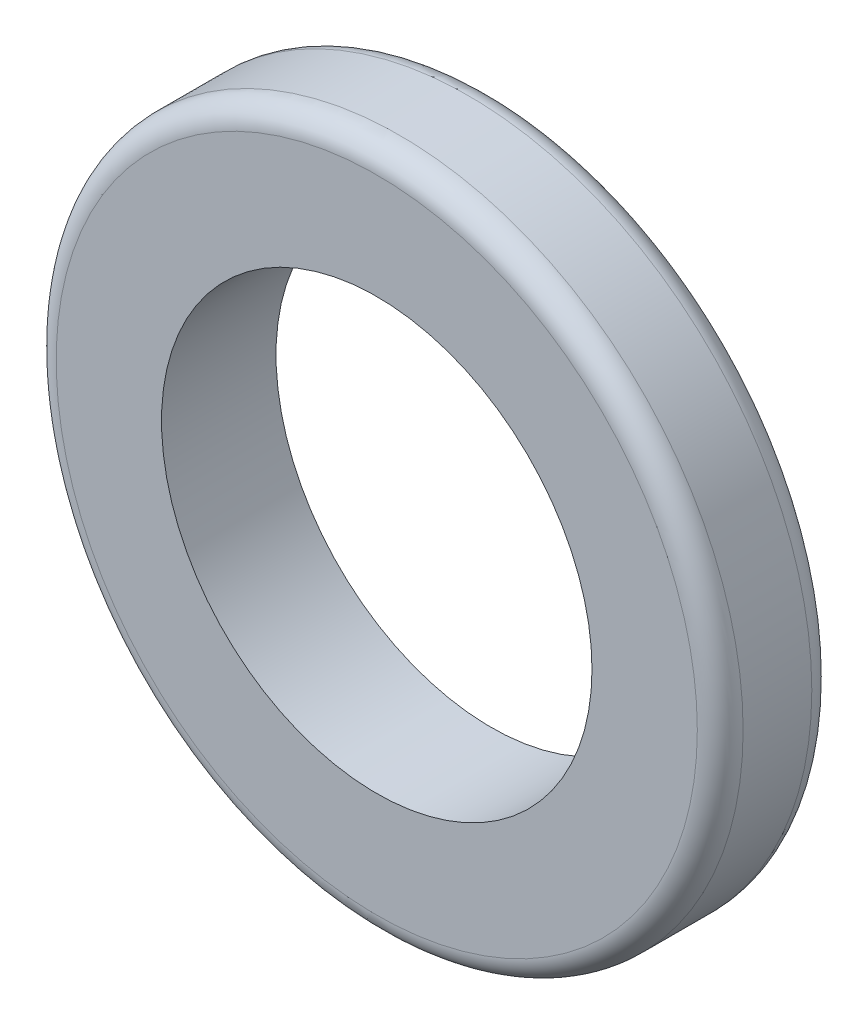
ISO-10303-21;
HEADER;
FILE_DESCRIPTION(('STEP AP214'),'2;1');
FILE_NAME('part.step','',(''),(''),'','','');
FILE_SCHEMA(('AUTOMOTIVE_DESIGN { 1 0 10303 214 1 1 1 1 }'));
ENDSEC;
DATA;
#1=APPLICATION_CONTEXT('core data for automotive mechanical design processes');
#2=APPLICATION_PROTOCOL_DEFINITION('international standard','automotive_design',2000,#1);
#3=PRODUCT_CONTEXT('',#1,'mechanical');
#4=PRODUCT('Part','Part','',(#3));
#5=PRODUCT_RELATED_PRODUCT_CATEGORY('part','',(#4));
#6=PRODUCT_DEFINITION_FORMATION('','',#4);
#7=PRODUCT_DEFINITION_CONTEXT('part definition',#1,'design');
#8=PRODUCT_DEFINITION('design','',#6,#7);
#9=PRODUCT_DEFINITION_SHAPE('','',#8);
#10=(LENGTH_UNIT() NAMED_UNIT(*) SI_UNIT(.MILLI.,.METRE.));
#11=(NAMED_UNIT(*) PLANE_ANGLE_UNIT() SI_UNIT($,.RADIAN.));
#12=(NAMED_UNIT(*) SI_UNIT($,.STERADIAN.) SOLID_ANGLE_UNIT());
#13=UNCERTAINTY_MEASURE_WITH_UNIT(LENGTH_MEASURE(1.E-05),#10,'distance_accuracy_value','');
#14=(GEOMETRIC_REPRESENTATION_CONTEXT(3) GLOBAL_UNCERTAINTY_ASSIGNED_CONTEXT((#13)) GLOBAL_UNIT_ASSIGNED_CONTEXT((#10,
#11,#12)) REPRESENTATION_CONTEXT('',''));
#15=CARTESIAN_POINT('',(0.,0.,0.));
#16=DIRECTION('',(0.,0.,1.));
#17=DIRECTION('',(1.,0.,0.));
#18=AXIS2_PLACEMENT_3D('',#15,#16,#17);
#19=CARTESIAN_POINT('',(0.,0.,12.7));
#20=DIRECTION('',(0.,0.,1.));
#21=DIRECTION('',(1.,0.,0.));
#22=AXIS2_PLACEMENT_3D('',#19,#20,#21);
#23=PLANE('',#22);
#24=CARTESIAN_POINT('',(0.,0.,12.7));
#25=DIRECTION('',(0.,0.,1.));
#26=DIRECTION('',(1.,0.,0.));
#27=AXIS2_PLACEMENT_3D('',#24,#25,#26);
#28=CIRCLE('',#27,35.56);
#29=CARTESIAN_POINT('',(35.56,0.,12.7));
#30=VERTEX_POINT('',#29);
#31=EDGE_CURVE('E10',#30,#30,#28,.T.);
#32=ORIENTED_EDGE('',*,*,#31,.T.);
#33=EDGE_LOOP('',(#32));
#34=FACE_BOUND('',#33,.T.);
#35=CARTESIAN_POINT('',(0.,0.,12.7));
#36=DIRECTION('',(0.,0.,1.));
#37=DIRECTION('',(1.,0.,0.));
#38=AXIS2_PLACEMENT_3D('',#35,#36,#37);
#39=CIRCLE('',#38,23.876);
#40=CARTESIAN_POINT('',(23.876,0.,12.7));
#41=VERTEX_POINT('',#40);
#42=EDGE_CURVE('E52',#41,#41,#39,.T.);
#43=ORIENTED_EDGE('',*,*,#42,.F.);
#44=EDGE_LOOP('',(#43));
#45=FACE_BOUND('',#44,.T.);
#46=ADVANCED_FACE('F32',(#34,#45),#23,.T.);
#47=CARTESIAN_POINT('',(0.,0.,0.));
#48=DIRECTION('',(0.,0.,1.));
#49=DIRECTION('',(1.,0.,0.));
#50=AXIS2_PLACEMENT_3D('',#47,#48,#49);
#51=PLANE('',#50);
#52=CARTESIAN_POINT('',(0.,0.,0.));
#53=DIRECTION('',(0.,0.,1.));
#54=DIRECTION('',(1.,0.,0.));
#55=AXIS2_PLACEMENT_3D('',#52,#53,#54);
#56=CIRCLE('',#55,35.56);
#57=CARTESIAN_POINT('',(35.56,0.,0.));
#58=VERTEX_POINT('',#57);
#59=EDGE_CURVE('E39',#58,#58,#56,.F.);
#60=ORIENTED_EDGE('',*,*,#59,.T.);
#61=EDGE_LOOP('',(#60));
#62=FACE_BOUND('',#61,.T.);
#63=CARTESIAN_POINT('',(0.,0.,0.));
#64=DIRECTION('',(0.,0.,1.));
#65=DIRECTION('',(1.,0.,0.));
#66=AXIS2_PLACEMENT_3D('',#63,#64,#65);
#67=CIRCLE('',#66,23.876);
#68=CARTESIAN_POINT('',(23.876,0.,0.));
#69=VERTEX_POINT('',#68);
#70=EDGE_CURVE('E53',#69,#69,#67,.T.);
#71=ORIENTED_EDGE('',*,*,#70,.T.);
#72=EDGE_LOOP('',(#71));
#73=FACE_BOUND('',#72,.T.);
#74=ADVANCED_FACE('F63',(#62,#73),#51,.F.);
#75=CARTESIAN_POINT('',(0.,0.,12.7));
#76=DIRECTION('',(0.,0.,-1.));
#77=DIRECTION('',(-1.,0.,0.));
#78=AXIS2_PLACEMENT_3D('',#75,#76,#77);
#79=CYLINDRICAL_SURFACE('',#78,38.1);
#80=CARTESIAN_POINT('',(0.,0.,2.54));
#81=DIRECTION('',(0.,0.,1.));
#82=DIRECTION('',(1.,0.,0.));
#83=AXIS2_PLACEMENT_3D('',#80,#81,#82);
#84=CIRCLE('',#83,38.1);
#85=CARTESIAN_POINT('',(38.1,0.,2.54));
#86=VERTEX_POINT('',#85);
#87=EDGE_CURVE('E43',#86,#86,#84,.T.);
#88=ORIENTED_EDGE('',*,*,#87,.T.);
#89=EDGE_LOOP('',(#88));
#90=FACE_BOUND('',#89,.T.);
#91=CARTESIAN_POINT('',(0.,0.,10.16));
#92=DIRECTION('',(0.,0.,1.));
#93=DIRECTION('',(1.,0.,0.));
#94=AXIS2_PLACEMENT_3D('',#91,#92,#93);
#95=CIRCLE('',#94,38.1);
#96=CARTESIAN_POINT('',(38.1,0.,10.16));
#97=VERTEX_POINT('',#96);
#98=EDGE_CURVE('E47',#97,#97,#95,.F.);
#99=ORIENTED_EDGE('',*,*,#98,.T.);
#100=EDGE_LOOP('',(#99));
#101=FACE_BOUND('',#100,.T.);
#102=ADVANCED_FACE('F69',(#90,#101),#79,.T.);
#103=CARTESIAN_POINT('',(0.,0.,12.7));
#104=DIRECTION('',(0.,0.,-1.));
#105=DIRECTION('',(-1.,0.,0.));
#106=AXIS2_PLACEMENT_3D('',#103,#104,#105);
#107=CYLINDRICAL_SURFACE('',#106,23.876);
#108=ORIENTED_EDGE('',*,*,#42,.T.);
#109=EDGE_LOOP('',(#108));
#110=FACE_BOUND('',#109,.T.);
#111=ORIENTED_EDGE('',*,*,#70,.F.);
#112=EDGE_LOOP('',(#111));
#113=FACE_BOUND('',#112,.T.);
#114=ADVANCED_FACE('F59',(#110,#113),#107,.F.);
#115=CARTESIAN_POINT('',(0.,0.,2.54));
#116=DIRECTION('',(0.,0.,1.));
#117=DIRECTION('',(1.,0.,0.));
#118=AXIS2_PLACEMENT_3D('',#115,#116,#117);
#119=TOROIDAL_SURFACE('',#118,35.56,2.54);
#120=ORIENTED_EDGE('',*,*,#59,.F.);
#121=EDGE_LOOP('',(#120));
#122=FACE_BOUND('',#121,.T.);
#123=ORIENTED_EDGE('',*,*,#87,.F.);
#124=EDGE_LOOP('',(#123));
#125=FACE_BOUND('',#124,.T.);
#126=ADVANCED_FACE('F75',(#122,#125),#119,.T.);
#127=CARTESIAN_POINT('',(0.,0.,10.16));
#128=DIRECTION('',(0.,0.,1.));
#129=DIRECTION('',(1.,0.,0.));
#130=AXIS2_PLACEMENT_3D('',#127,#128,#129);
#131=TOROIDAL_SURFACE('',#130,35.56,2.54);
#132=ORIENTED_EDGE('',*,*,#98,.F.);
#133=EDGE_LOOP('',(#132));
#134=FACE_BOUND('',#133,.T.);
#135=ORIENTED_EDGE('',*,*,#31,.F.);
#136=EDGE_LOOP('',(#135));
#137=FACE_BOUND('',#136,.T.);
#138=ADVANCED_FACE('F34',(#134,#137),#131,.T.);
#139=CLOSED_SHELL('',(#46,#74,#102,#114,#126,#138));
#140=MANIFOLD_SOLID_BREP('B2',#139);
#141=ADVANCED_BREP_SHAPE_REPRESENTATION('',(#18,#140),#14);
#142=SHAPE_DEFINITION_REPRESENTATION(#9,#141);
ENDSEC;
END-ISO-10303-21;
